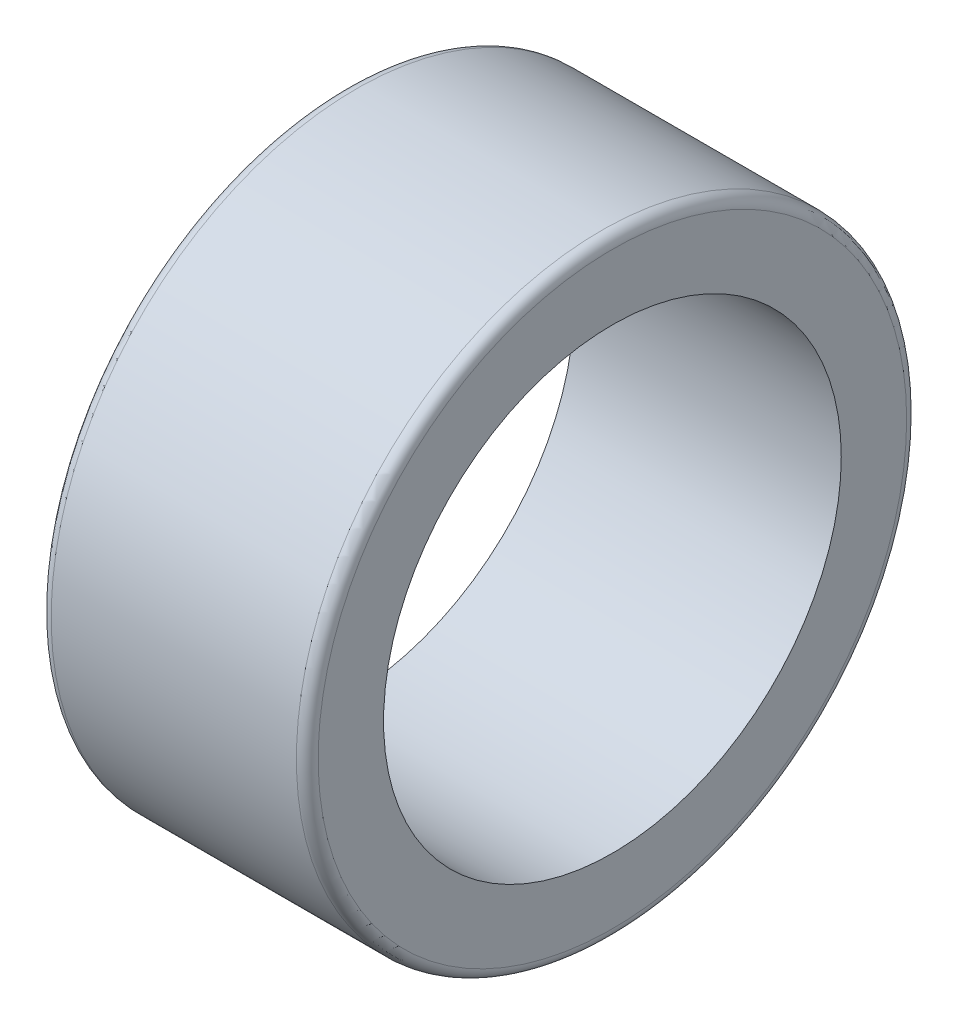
ISO-10303-21;
HEADER;
FILE_DESCRIPTION(('STEP AP214'),'2;1');
FILE_NAME('part.step','',(''),(''),'','','');
FILE_SCHEMA(('AUTOMOTIVE_DESIGN { 1 0 10303 214 1 1 1 1 }'));
ENDSEC;
DATA;
#1=APPLICATION_CONTEXT('core data for automotive mechanical design processes');
#2=APPLICATION_PROTOCOL_DEFINITION('international standard','automotive_design',2000,#1);
#3=PRODUCT_CONTEXT('',#1,'mechanical');
#4=PRODUCT('Part','Part','',(#3));
#5=PRODUCT_RELATED_PRODUCT_CATEGORY('part','',(#4));
#6=PRODUCT_DEFINITION_FORMATION('','',#4);
#7=PRODUCT_DEFINITION_CONTEXT('part definition',#1,'design');
#8=PRODUCT_DEFINITION('design','',#6,#7);
#9=PRODUCT_DEFINITION_SHAPE('','',#8);
#10=(LENGTH_UNIT() NAMED_UNIT(*) SI_UNIT(.MILLI.,.METRE.));
#11=(NAMED_UNIT(*) PLANE_ANGLE_UNIT() SI_UNIT($,.RADIAN.));
#12=(NAMED_UNIT(*) SI_UNIT($,.STERADIAN.) SOLID_ANGLE_UNIT());
#13=UNCERTAINTY_MEASURE_WITH_UNIT(LENGTH_MEASURE(1.E-05),#10,'distance_accuracy_value','');
#14=(GEOMETRIC_REPRESENTATION_CONTEXT(3) GLOBAL_UNCERTAINTY_ASSIGNED_CONTEXT((#13)) GLOBAL_UNIT_ASSIGNED_CONTEXT((#10,
#11,#12)) REPRESENTATION_CONTEXT('',''));
#15=CARTESIAN_POINT('',(0.,0.,0.));
#16=DIRECTION('',(0.,0.,1.));
#17=DIRECTION('',(1.,0.,0.));
#18=AXIS2_PLACEMENT_3D('',#15,#16,#17);
#19=CARTESIAN_POINT('',(24.5,27.,0.));
#20=DIRECTION('',(1.,0.,0.));
#21=DIRECTION('',(0.,0.,-1.));
#22=AXIS2_PLACEMENT_3D('',#19,#20,#21);
#23=PLANE('',#22);
#24=CARTESIAN_POINT('',(24.5,0.,0.));
#25=DIRECTION('',(1.,0.,0.));
#26=DIRECTION('',(0.,0.,-1.));
#27=AXIS2_PLACEMENT_3D('',#24,#25,#26);
#28=CIRCLE('',#27,27.);
#29=CARTESIAN_POINT('',(24.5,0.,-27.));
#30=VERTEX_POINT('',#29);
#31=EDGE_CURVE('E10',#30,#30,#28,.T.);
#32=ORIENTED_EDGE('',*,*,#31,.T.);
#33=EDGE_LOOP('',(#32));
#34=FACE_BOUND('',#33,.T.);
#35=CARTESIAN_POINT('',(24.5,0.,0.));
#36=DIRECTION('',(1.,0.,0.));
#37=DIRECTION('',(0.,0.,-1.));
#38=AXIS2_PLACEMENT_3D('',#35,#36,#37);
#39=CIRCLE('',#38,21.);
#40=CARTESIAN_POINT('',(24.5,0.,-21.));
#41=VERTEX_POINT('',#40);
#42=EDGE_CURVE('E53',#41,#41,#39,.T.);
#43=ORIENTED_EDGE('',*,*,#42,.F.);
#44=EDGE_LOOP('',(#43));
#45=FACE_BOUND('',#44,.T.);
#46=ADVANCED_FACE('F31',(#34,#45),#23,.T.);
#47=CARTESIAN_POINT('',(23.5,0.,0.));
#48=DIRECTION('',(1.,0.,0.));
#49=DIRECTION('',(0.,0.,-1.));
#50=AXIS2_PLACEMENT_3D('',#47,#48,#49);
#51=TOROIDAL_SURFACE('',#50,27.,1.);
#52=CARTESIAN_POINT('',(23.5,0.,0.));
#53=DIRECTION('',(1.,0.,0.));
#54=DIRECTION('',(0.,0.,-1.));
#55=AXIS2_PLACEMENT_3D('',#52,#53,#54);
#56=CIRCLE('',#55,28.);
#57=CARTESIAN_POINT('',(23.5,0.,-28.));
#58=VERTEX_POINT('',#57);
#59=EDGE_CURVE('E37',#58,#58,#56,.T.);
#60=ORIENTED_EDGE('',*,*,#59,.T.);
#61=EDGE_LOOP('',(#60));
#62=FACE_BOUND('',#61,.T.);
#63=ORIENTED_EDGE('',*,*,#31,.F.);
#64=EDGE_LOOP('',(#63));
#65=FACE_BOUND('',#64,.T.);
#66=ADVANCED_FACE('F61',(#62,#65),#51,.T.);
#67=CARTESIAN_POINT('',(39.2883468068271,0.,0.));
#68=DIRECTION('',(1.,0.,0.));
#69=DIRECTION('',(0.,0.,-1.));
#70=AXIS2_PLACEMENT_3D('',#67,#68,#69);
#71=CYLINDRICAL_SURFACE('',#70,28.);
#72=CARTESIAN_POINT('',(1.00000000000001,0.,0.));
#73=DIRECTION('',(1.,0.,0.));
#74=DIRECTION('',(0.,0.,-1.));
#75=AXIS2_PLACEMENT_3D('',#72,#73,#74);
#76=CIRCLE('',#75,28.);
#77=CARTESIAN_POINT('',(1.00000000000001,0.,-28.));
#78=VERTEX_POINT('',#77);
#79=EDGE_CURVE('E41',#78,#78,#76,.T.);
#80=ORIENTED_EDGE('',*,*,#79,.T.);
#81=EDGE_LOOP('',(#80));
#82=FACE_BOUND('',#81,.T.);
#83=ORIENTED_EDGE('',*,*,#59,.F.);
#84=EDGE_LOOP('',(#83));
#85=FACE_BOUND('',#84,.T.);
#86=ADVANCED_FACE('F65',(#82,#85),#71,.T.);
#87=CARTESIAN_POINT('',(1.,0.,0.));
#88=DIRECTION('',(1.,0.,0.));
#89=DIRECTION('',(0.,0.,-1.));
#90=AXIS2_PLACEMENT_3D('',#87,#88,#89);
#91=TOROIDAL_SURFACE('',#90,27.,1.);
#92=CARTESIAN_POINT('',(0.,0.,0.));
#93=DIRECTION('',(1.,0.,0.));
#94=DIRECTION('',(0.,0.,-1.));
#95=AXIS2_PLACEMENT_3D('',#92,#93,#94);
#96=CIRCLE('',#95,27.);
#97=CARTESIAN_POINT('',(0.,0.,-27.));
#98=VERTEX_POINT('',#97);
#99=EDGE_CURVE('E45',#98,#98,#96,.T.);
#100=ORIENTED_EDGE('',*,*,#99,.T.);
#101=EDGE_LOOP('',(#100));
#102=FACE_BOUND('',#101,.T.);
#103=ORIENTED_EDGE('',*,*,#79,.F.);
#104=EDGE_LOOP('',(#103));
#105=FACE_BOUND('',#104,.T.);
#106=ADVANCED_FACE('F69',(#102,#105),#91,.T.);
#107=CARTESIAN_POINT('',(0.,27.,0.));
#108=DIRECTION('',(-1.,0.,0.));
#109=DIRECTION('',(0.,0.,1.));
#110=AXIS2_PLACEMENT_3D('',#107,#108,#109);
#111=PLANE('',#110);
#112=CARTESIAN_POINT('',(0.,0.,0.));
#113=DIRECTION('',(1.,0.,0.));
#114=DIRECTION('',(0.,0.,-1.));
#115=AXIS2_PLACEMENT_3D('',#112,#113,#114);
#116=CIRCLE('',#115,21.);
#117=CARTESIAN_POINT('',(0.,0.,-21.));
#118=VERTEX_POINT('',#117);
#119=EDGE_CURVE('E50',#118,#118,#116,.T.);
#120=ORIENTED_EDGE('',*,*,#119,.T.);
#121=EDGE_LOOP('',(#120));
#122=FACE_BOUND('',#121,.T.);
#123=ORIENTED_EDGE('',*,*,#99,.F.);
#124=EDGE_LOOP('',(#123));
#125=FACE_BOUND('',#124,.T.);
#126=ADVANCED_FACE('F76',(#122,#125),#111,.T.);
#127=CARTESIAN_POINT('',(39.2883468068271,0.,0.));
#128=DIRECTION('',(1.,0.,0.));
#129=DIRECTION('',(0.,0.,-1.));
#130=AXIS2_PLACEMENT_3D('',#127,#128,#129);
#131=CYLINDRICAL_SURFACE('',#130,21.);
#132=ORIENTED_EDGE('',*,*,#42,.T.);
#133=EDGE_LOOP('',(#132));
#134=FACE_BOUND('',#133,.T.);
#135=ORIENTED_EDGE('',*,*,#119,.F.);
#136=EDGE_LOOP('',(#135));
#137=FACE_BOUND('',#136,.T.);
#138=ADVANCED_FACE('F57',(#134,#137),#131,.F.);
#139=CLOSED_SHELL('',(#46,#66,#86,#106,#126,#138));
#140=MANIFOLD_SOLID_BREP('B2',#139);
#141=ADVANCED_BREP_SHAPE_REPRESENTATION('',(#18,#140),#14);
#142=SHAPE_DEFINITION_REPRESENTATION(#9,#141);
ENDSEC;
END-ISO-10303-21;
